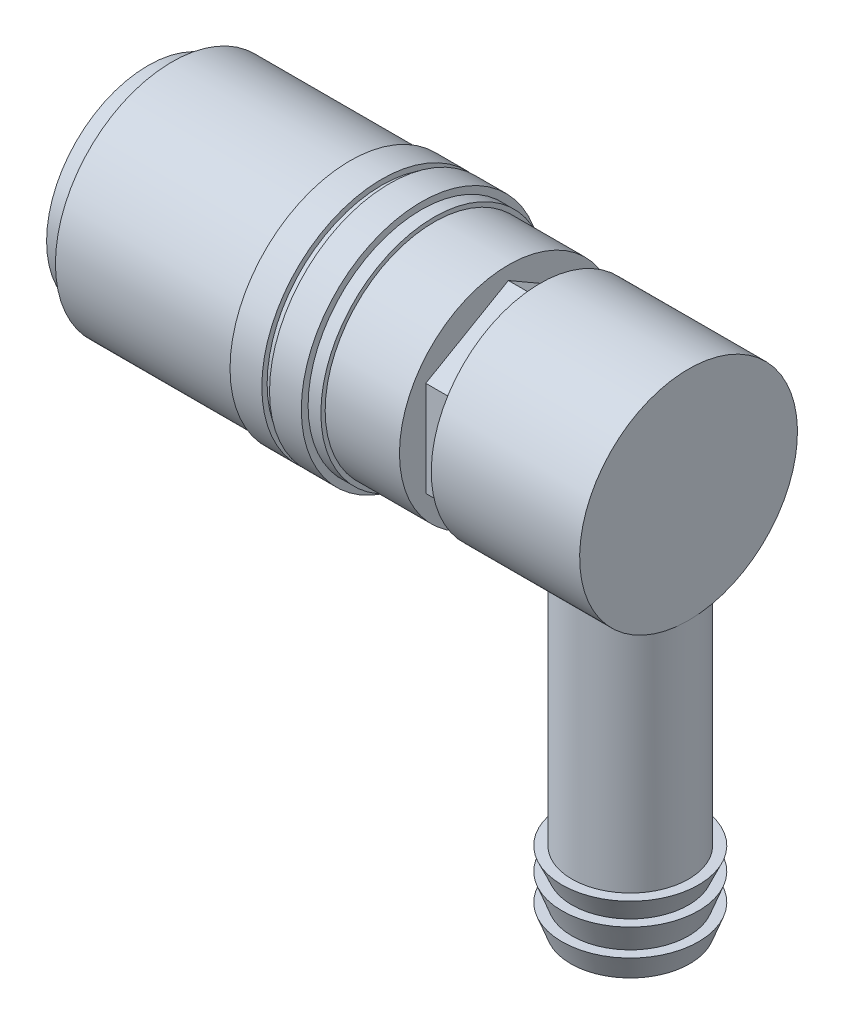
ISO-10303-21;
HEADER;
FILE_DESCRIPTION(('STEP AP214'),'2;1');
FILE_NAME('part.step','',(''),(''),'','','');
FILE_SCHEMA(('AUTOMOTIVE_DESIGN { 1 0 10303 214 1 1 1 1 }'));
ENDSEC;
DATA;
#1=APPLICATION_CONTEXT('core data for automotive mechanical design processes');
#2=APPLICATION_PROTOCOL_DEFINITION('international standard','automotive_design',2000,#1);
#3=PRODUCT_CONTEXT('',#1,'mechanical');
#4=PRODUCT('Part','Part','',(#3));
#5=PRODUCT_RELATED_PRODUCT_CATEGORY('part','',(#4));
#6=PRODUCT_DEFINITION_FORMATION('','',#4);
#7=PRODUCT_DEFINITION_CONTEXT('part definition',#1,'design');
#8=PRODUCT_DEFINITION('design','',#6,#7);
#9=PRODUCT_DEFINITION_SHAPE('','',#8);
#10=(LENGTH_UNIT() NAMED_UNIT(*) SI_UNIT(.MILLI.,.METRE.));
#11=(NAMED_UNIT(*) PLANE_ANGLE_UNIT() SI_UNIT($,.RADIAN.));
#12=(NAMED_UNIT(*) SI_UNIT($,.STERADIAN.) SOLID_ANGLE_UNIT());
#13=UNCERTAINTY_MEASURE_WITH_UNIT(LENGTH_MEASURE(1.E-05),#10,'distance_accuracy_value','');
#14=(GEOMETRIC_REPRESENTATION_CONTEXT(3) GLOBAL_UNCERTAINTY_ASSIGNED_CONTEXT((#13)) GLOBAL_UNIT_ASSIGNED_CONTEXT((#10,
#11,#12)) REPRESENTATION_CONTEXT('',''));
#15=CARTESIAN_POINT('',(0.,0.,0.));
#16=DIRECTION('',(0.,0.,1.));
#17=DIRECTION('',(1.,0.,0.));
#18=AXIS2_PLACEMENT_3D('',#15,#16,#17);
#19=CARTESIAN_POINT('',(51.,0.,0.));
#20=DIRECTION('',(-1.,0.,0.));
#21=DIRECTION('',(0.,0.,1.));
#22=AXIS2_PLACEMENT_3D('',#19,#20,#21);
#23=CYLINDRICAL_SURFACE('',#22,10.2763207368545);
#24=CARTESIAN_POINT('',(37.,0.,0.));
#25=DIRECTION('',(1.,0.,0.));
#26=DIRECTION('',(0.,0.,-1.));
#27=AXIS2_PLACEMENT_3D('',#24,#25,#26);
#28=CIRCLE('',#27,10.2763207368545);
#29=CARTESIAN_POINT('',(37.,0.,-10.2763207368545));
#30=VERTEX_POINT('',#29);
#31=EDGE_CURVE('E79',#30,#30,#28,.T.);
#32=ORIENTED_EDGE('',*,*,#31,.T.);
#33=EDGE_LOOP('',(#32));
#34=FACE_BOUND('',#33,.T.);
#35=CARTESIAN_POINT('',(51.,0.,0.));
#36=DIRECTION('',(1.,0.,0.));
#37=DIRECTION('',(0.,0.,-1.));
#38=AXIS2_PLACEMENT_3D('',#35,#36,#37);
#39=CIRCLE('',#38,10.2763207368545);
#40=CARTESIAN_POINT('',(51.,-10.2763207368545,0.));
#41=VERTEX_POINT('',#40);
#42=EDGE_CURVE('E74',#41,#41,#39,.T.);
#43=ORIENTED_EDGE('',*,*,#42,.F.);
#44=CARTESIAN_POINT('',(51.,-10.2763207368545,0.));
#45=CARTESIAN_POINT('',(51.0000007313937,-10.2763213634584,0.143384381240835));
#46=CARTESIAN_POINT('',(50.9943873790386,-10.273313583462,0.286759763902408));
#47=CARTESIAN_POINT('',(50.9720057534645,-10.2613607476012,0.572438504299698));
#48=CARTESIAN_POINT('',(50.955233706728,-10.252413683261,0.714741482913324));
#49=CARTESIAN_POINT('',(50.910719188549,-10.228797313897,0.997294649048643));
#50=CARTESIAN_POINT('',(50.8829646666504,-10.214121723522,1.1375424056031));
#51=CARTESIAN_POINT('',(50.8168085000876,-10.1794119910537,1.41487883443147));
#52=CARTESIAN_POINT('',(50.7784025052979,-10.1593756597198,1.55196619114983));
#53=CARTESIAN_POINT('',(50.6915661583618,-10.1145315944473,1.82142329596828));
#54=CARTESIAN_POINT('',(50.6431818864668,-10.0897458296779,1.95381156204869));
#55=CARTESIAN_POINT('',(50.5367605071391,-10.0359168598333,2.21377441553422));
#56=CARTESIAN_POINT('',(50.4787197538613,-10.00687204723,2.34134716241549));
#57=CARTESIAN_POINT('',(50.2909113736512,-9.91431573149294,2.71569378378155));
#58=CARTESIAN_POINT('',(50.1473689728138,-9.84533512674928,2.95436795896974));
#59=CARTESIAN_POINT('',(49.8170752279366,-9.693657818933,3.42051176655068));
#60=CARTESIAN_POINT('',(49.6280876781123,-9.61035449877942,3.64618510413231));
#61=CARTESIAN_POINT('',(49.2171598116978,-9.44112784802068,4.06433316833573));
#62=CARTESIAN_POINT('',(48.9951907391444,-9.35520228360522,4.25677860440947));
#63=CARTESIAN_POINT('',(48.4999870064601,-9.18119507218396,4.62091035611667));
#64=CARTESIAN_POINT('',(48.2239144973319,-9.09364255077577,4.78905710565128));
#65=CARTESIAN_POINT('',(47.7881515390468,-8.97601207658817,5.00406630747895));
#66=CARTESIAN_POINT('',(47.6392358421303,-8.93907511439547,5.06954957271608));
#67=CARTESIAN_POINT('',(47.3350241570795,-8.87119759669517,5.1874118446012));
#68=CARTESIAN_POINT('',(47.179732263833,-8.84025326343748,5.23979911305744));
#69=CARTESIAN_POINT('',(46.8736914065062,-8.78740611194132,5.32792091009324));
#70=CARTESIAN_POINT('',(46.723257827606,-8.76506163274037,5.36448660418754));
#71=CARTESIAN_POINT('',(46.4190208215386,-8.72780632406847,5.42488975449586));
#72=CARTESIAN_POINT('',(46.2652193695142,-8.71289125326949,5.44873447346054));
#73=CARTESIAN_POINT('',(45.9557052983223,-8.69118093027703,5.48329841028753));
#74=CARTESIAN_POINT('',(45.7999943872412,-8.68437888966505,5.49402860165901));
#75=CARTESIAN_POINT('',(45.4880924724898,-8.67920557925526,5.50219829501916));
#76=CARTESIAN_POINT('',(45.3319015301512,-8.68083327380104,5.49963942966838));
#77=CARTESIAN_POINT('',(45.0428041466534,-8.69160415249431,5.48259604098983));
#78=CARTESIAN_POINT('',(44.9097485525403,-8.69964436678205,5.46986123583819));
#79=CARTESIAN_POINT('',(44.6453503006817,-8.72157289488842,5.43482861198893));
#80=CARTESIAN_POINT('',(44.5140081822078,-8.73546300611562,5.41252785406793));
#81=CARTESIAN_POINT('',(44.2539460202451,-8.76862508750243,5.3586360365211));
#82=CARTESIAN_POINT('',(44.1252258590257,-8.78789681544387,5.327045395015));
#83=CARTESIAN_POINT('',(43.8711188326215,-8.83121260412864,5.25492298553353));
#84=CARTESIAN_POINT('',(43.7457333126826,-8.85525855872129,5.21438766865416));
#85=CARTESIAN_POINT('',(43.3701504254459,-8.93467483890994,5.07795428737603));
#86=CARTESIAN_POINT('',(43.1261382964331,-8.99656314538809,4.96840138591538));
#87=CARTESIAN_POINT('',(42.6588488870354,-9.13096923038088,4.71682661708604));
#88=CARTESIAN_POINT('',(42.4355808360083,-9.20349170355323,4.57479039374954));
#89=CARTESIAN_POINT('',(41.9811566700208,-9.36394100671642,4.23782400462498));
#90=CARTESIAN_POINT('',(41.7537312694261,-9.45255834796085,4.03817526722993));
#91=CARTESIAN_POINT('',(41.3338285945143,-9.6266916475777,3.60337503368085));
#92=CARTESIAN_POINT('',(41.1413729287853,-9.71220566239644,3.36820174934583));
#93=CARTESIAN_POINT('',(40.877475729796,-9.83432629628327,2.98468842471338));
#94=CARTESIAN_POINT('',(40.7916210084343,-9.87505563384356,2.8473743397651));
#95=CARTESIAN_POINT('',(40.6319279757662,-9.95218536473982,2.56479583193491));
#96=CARTESIAN_POINT('',(40.5580845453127,-9.98858760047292,2.41953483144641));
#97=CARTESIAN_POINT('',(40.4232337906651,-10.0559890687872,2.12205274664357));
#98=CARTESIAN_POINT('',(40.3622203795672,-10.0869908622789,1.96983500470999));
#99=CARTESIAN_POINT('',(40.2537631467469,-10.1426623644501,1.65951781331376));
#100=CARTESIAN_POINT('',(40.2063175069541,-10.1673329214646,1.50141915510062));
#101=CARTESIAN_POINT('',(40.1293222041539,-10.2076429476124,1.19517893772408));
#102=CARTESIAN_POINT('',(40.098543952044,-10.2238964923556,1.04742632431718));
#103=CARTESIAN_POINT('',(40.0491933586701,-10.2500546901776,0.749347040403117));
#104=CARTESIAN_POINT('',(40.030619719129,-10.2599600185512,0.599020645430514));
#105=CARTESIAN_POINT('',(40.0059448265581,-10.2731349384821,0.297128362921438));
#106=CARTESIAN_POINT('',(39.9998377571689,-10.2764076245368,0.145563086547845));
#107=CARTESIAN_POINT('',(40.0001687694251,-10.2762303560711,-0.157545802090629));
#108=CARTESIAN_POINT('',(40.0066061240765,-10.272780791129,-0.309089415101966));
#109=CARTESIAN_POINT('',(40.0307638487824,-10.2598840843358,-0.59696506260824));
#110=CARTESIAN_POINT('',(40.0473941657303,-10.2510166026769,-0.733416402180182));
#111=CARTESIAN_POINT('',(40.090730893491,-10.228031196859,-1.00430416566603));
#112=CARTESIAN_POINT('',(40.1174404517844,-10.2139116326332,-1.1387399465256));
#113=CARTESIAN_POINT('',(40.180629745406,-10.180753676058,-1.40462367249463));
#114=CARTESIAN_POINT('',(40.2171063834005,-10.1617168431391,-1.5360725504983));
#115=CARTESIAN_POINT('',(40.299475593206,-10.1191392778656,-1.79528551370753));
#116=CARTESIAN_POINT('',(40.3453718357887,-10.0955967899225,-1.92304814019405));
#117=CARTESIAN_POINT('',(40.4473760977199,-10.0438933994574,-2.17719769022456));
#118=CARTESIAN_POINT('',(40.5037048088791,-10.0156343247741,-2.30347607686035));
#119=CARTESIAN_POINT('',(40.6253158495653,-9.9555275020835,-2.55077637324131));
#120=CARTESIAN_POINT('',(40.6906012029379,-9.92367854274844,-2.67179648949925));
#121=CARTESIAN_POINT('',(40.8991523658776,-9.82372684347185,-3.02609576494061));
#122=CARTESIAN_POINT('',(41.0551699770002,-9.75118969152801,-3.25075381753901));
#123=CARTESIAN_POINT('',(41.4160266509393,-9.59180082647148,-3.6962157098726));
#124=CARTESIAN_POINT('',(41.6243212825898,-9.50424945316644,-3.91397370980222));
#125=CARTESIAN_POINT('',(41.9612584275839,-9.37362008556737,-4.2130667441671));
#126=CARTESIAN_POINT('',(42.0777588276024,-9.33015793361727,-4.30824039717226));
#127=CARTESIAN_POINT('',(42.3185314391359,-9.2445575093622,-4.48897608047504));
#128=CARTESIAN_POINT('',(42.4428049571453,-9.20241946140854,-4.57453648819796));
#129=CARTESIAN_POINT('',(42.7073735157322,-9.11782656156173,-4.74102559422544));
#130=CARTESIAN_POINT('',(42.8481825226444,-9.07554974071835,-4.82122953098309));
#131=CARTESIAN_POINT('',(43.137258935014,-8.99533482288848,-4.96928642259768));
#132=CARTESIAN_POINT('',(43.285522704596,-8.95739463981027,-5.03714532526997));
#133=CARTESIAN_POINT('',(43.588556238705,-8.88733276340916,-5.15975496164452));
#134=CARTESIAN_POINT('',(43.7433200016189,-8.85520584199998,-5.21451748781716));
#135=CARTESIAN_POINT('',(44.0583440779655,-8.7981344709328,-5.31024604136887));
#136=CARTESIAN_POINT('',(44.2186034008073,-8.77318873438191,-5.35121454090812));
#137=CARTESIAN_POINT('',(44.5273175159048,-8.73371553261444,-5.41537218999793));
#138=CARTESIAN_POINT('',(44.6753928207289,-8.71840744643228,-5.4399088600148));
#139=CARTESIAN_POINT('',(44.9736343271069,-8.69527106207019,-5.47681557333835));
#140=CARTESIAN_POINT('',(45.1238003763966,-8.68744222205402,-5.48918649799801));
#141=CARTESIAN_POINT('',(45.4247562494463,-8.67962064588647,-5.50154591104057));
#142=CARTESIAN_POINT('',(45.5755456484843,-8.67962324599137,-5.50154176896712));
#143=CARTESIAN_POINT('',(45.8764027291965,-8.68745275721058,-5.48916988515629));
#144=CARTESIAN_POINT('',(46.0264704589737,-8.69527913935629,-5.47680297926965));
#145=CARTESIAN_POINT('',(46.3060843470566,-8.71697056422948,-5.44220069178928));
#146=CARTESIAN_POINT('',(46.4358749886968,-8.72996995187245,-5.42137351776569));
#147=CARTESIAN_POINT('',(46.6930374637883,-8.761266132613,-5.37064815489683));
#148=CARTESIAN_POINT('',(46.8204084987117,-8.77956464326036,-5.34074702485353));
#149=CARTESIAN_POINT('',(47.1977255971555,-8.84158779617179,-5.2378981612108));
#150=CARTESIAN_POINT('',(47.4430393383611,-8.89245388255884,-5.15178422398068));
#151=CARTESIAN_POINT('',(47.9314845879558,-9.01138043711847,-4.94097714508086));
#152=CARTESIAN_POINT('',(48.1734672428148,-9.08033439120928,-4.81416406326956));
#153=CARTESIAN_POINT('',(48.6343820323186,-9.22655460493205,-4.52761771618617));
#154=CARTESIAN_POINT('',(48.8533016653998,-9.30382532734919,-4.36786673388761));
#155=CARTESIAN_POINT('',(49.2951580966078,-9.4714445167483,-3.99282049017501));
#156=CARTESIAN_POINT('',(49.5140144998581,-9.56205516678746,-3.77282095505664));
#157=CARTESIAN_POINT('',(49.9130394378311,-9.73629475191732,-3.29716926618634));
#158=CARTESIAN_POINT('',(50.0931826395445,-9.81991909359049,-3.04149394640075));
#159=CARTESIAN_POINT('',(50.332023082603,-9.93459736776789,-2.63200830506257));
#160=CARTESIAN_POINT('',(50.4071587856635,-9.97142996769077,-2.48917711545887));
#161=CARTESIAN_POINT('',(50.5449614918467,-10.0399610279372,-2.19647140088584));
#162=CARTESIAN_POINT('',(50.6076346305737,-10.071662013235,-2.04660038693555));
#163=CARTESIAN_POINT('',(50.7196479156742,-10.1289279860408,-1.7411740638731));
#164=CARTESIAN_POINT('',(50.7690147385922,-10.1545052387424,-1.58563084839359));
#165=CARTESIAN_POINT('',(50.8538752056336,-10.1987957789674,-1.26992675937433));
#166=CARTESIAN_POINT('',(50.8893764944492,-10.2175128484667,-1.10976848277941));
#167=CARTESIAN_POINT('',(50.9449782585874,-10.2469518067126,-0.792017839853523));
#168=CARTESIAN_POINT('',(50.9655833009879,-10.2579352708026,-0.63453799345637));
#169=CARTESIAN_POINT('',(50.9930938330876,-10.2726194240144,-0.318035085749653));
#170=CARTESIAN_POINT('',(50.9999991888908,-10.2763200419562,-0.159012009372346));
#171=CARTESIAN_POINT('',(51.,-10.2763207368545,0.));
#172=B_SPLINE_CURVE_WITH_KNOTS('',3,(#44,#45,#46,#47,#48,#49,#50,#51,#52,#53,#54,#55,#56,#57,
#58,#59,#60,#61,#62,#63,#64,#65,#66,#67,#68,#69,#70,#71,#72,#73,#74,#75,#76,#77,#78,#79,#80,#81,
#82,#83,#84,#85,#86,#87,#88,#89,#90,#91,#92,#93,#94,#95,#96,#97,#98,#99,#100,#101,#102,#103,
#104,#105,#106,#107,#108,#109,#110,#111,#112,#113,#114,#115,#116,#117,#118,#119,#120,#121,#122,
#123,#124,#125,#126,#127,#128,#129,#130,#131,#132,#133,#134,#135,#136,#137,#138,#139,#140,#141,
#142,#143,#144,#145,#146,#147,#148,#149,#150,#151,#152,#153,#154,#155,#156,#157,#158,#159,#160,
#161,#162,#163,#164,#165,#166,#167,#168,#169,#170,#171),.UNSPECIFIED.,.T.,.F.,(4,2,2,2,2,2,2,2,
2,2,2,2,2,2,2,2,2,2,2,2,2,2,2,2,2,2,2,2,2,2,2,2,2,2,2,2,2,2,2,2,2,2,2,2,2,2,2,2,2,2,2,2,2,2,2,2,
2,2,2,2,2,2,2,4),(0.,0.429997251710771,0.86013998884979,1.29075601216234,1.72154816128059,
2.15039373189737,2.57940158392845,3.43655755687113,4.35062885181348,5.2655018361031,
6.26455728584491,6.76441267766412,7.26395192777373,7.73251618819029,8.20081264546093,
8.66871698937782,9.13656384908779,9.53780349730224,9.93916651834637,10.3405114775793,
10.7420159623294,11.5621823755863,12.3827119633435,13.3247882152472,14.2674446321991,
14.7678416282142,15.2680247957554,15.767970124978,16.2678484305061,16.7226167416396,
17.177336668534,17.6318443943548,18.0863257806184,18.4990849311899,18.9119730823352,
19.3247304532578,19.7376489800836,20.1605831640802,20.5836604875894,21.4293583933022,
22.3665396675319,22.8358998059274,23.3053390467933,23.8071073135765,24.3086331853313,
24.8097057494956,25.3106884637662,25.7626464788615,26.2145717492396,26.6662278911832,
27.1178534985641,27.5136744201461,27.909623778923,28.7010315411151,29.5431926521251,
30.3858079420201,31.3514508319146,32.3177237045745,32.8137559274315,33.3095433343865,
33.8043292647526,34.2988420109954,34.7757004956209,35.2525636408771),.UNSPECIFIED.);
#173=EDGE_CURVE('E76',#41,#41,#172,.T.);
#174=ORIENTED_EDGE('',*,*,#173,.F.);
#175=EDGE_LOOP('',(#43,#174));
#176=FACE_BOUND('',#175,.T.);
#177=ADVANCED_FACE('F15',(#34,#176),#23,.T.);
#178=CARTESIAN_POINT('',(34.,6.8,0.));
#179=DIRECTION('',(-1.,0.,0.));
#180=DIRECTION('',(0.,0.,1.));
#181=AXIS2_PLACEMENT_3D('',#178,#179,#180);
#182=PLANE('',#181);
#183=CARTESIAN_POINT('',(34.,0.,0.));
#184=DIRECTION('',(-1.,0.,0.));
#185=DIRECTION('',(0.,0.,1.));
#186=AXIS2_PLACEMENT_3D('',#183,#184,#185);
#187=CIRCLE('',#186,10.2763207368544);
#188=CARTESIAN_POINT('',(34.,0.,10.2763207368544));
#189=VERTEX_POINT('',#188);
#190=EDGE_CURVE('E180',#189,#189,#187,.T.);
#191=ORIENTED_EDGE('',*,*,#190,.F.);
#192=EDGE_LOOP('',(#191));
#193=FACE_BOUND('',#192,.T.);
#194=DIRECTION('',(0.,0.5,0.866025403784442));
#195=VECTOR('',#194,1.);
#196=CARTESIAN_POINT('',(34.,4.50000000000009,-7.7942286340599));
#197=LINE('',#196,#195);
#198=CARTESIAN_POINT('',(34.,4.50000000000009,-7.7942286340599));
#199=VERTEX_POINT('',#198);
#200=CARTESIAN_POINT('',(34.,9.,0.));
#201=VERTEX_POINT('',#200);
#202=EDGE_CURVE('E95',#199,#201,#197,.T.);
#203=ORIENTED_EDGE('',*,*,#202,.F.);
#204=DIRECTION('',(0.,1.,0.));
#205=VECTOR('',#204,1.);
#206=CARTESIAN_POINT('',(34.,-4.49999999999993,-7.79422863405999));
#207=LINE('',#206,#205);
#208=CARTESIAN_POINT('',(34.,-4.49999999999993,-7.79422863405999));
#209=VERTEX_POINT('',#208);
#210=EDGE_CURVE('E100',#209,#199,#207,.T.);
#211=ORIENTED_EDGE('',*,*,#210,.F.);
#212=DIRECTION('',(0.,0.500000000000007,-0.866025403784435));
#213=VECTOR('',#212,1.);
#214=CARTESIAN_POINT('',(34.,-9.,0.));
#215=LINE('',#214,#213);
#216=CARTESIAN_POINT('',(34.,-9.,0.));
#217=VERTEX_POINT('',#216);
#218=EDGE_CURVE('E123',#217,#209,#215,.T.);
#219=ORIENTED_EDGE('',*,*,#218,.F.);
#220=DIRECTION('',(0.,-0.5,-0.866025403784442));
#221=VECTOR('',#220,1.);
#222=CARTESIAN_POINT('',(34.,-4.5,7.79422863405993));
#223=LINE('',#222,#221);
#224=CARTESIAN_POINT('',(34.,-4.5,7.79422863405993));
#225=VERTEX_POINT('',#224);
#226=EDGE_CURVE('E120',#225,#217,#223,.T.);
#227=ORIENTED_EDGE('',*,*,#226,.F.);
#228=DIRECTION('',(0.,-1.,0.));
#229=VECTOR('',#228,1.);
#230=CARTESIAN_POINT('',(34.,4.5,7.79422863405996));
#231=LINE('',#230,#229);
#232=CARTESIAN_POINT('',(34.,4.5,7.79422863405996));
#233=VERTEX_POINT('',#232);
#234=EDGE_CURVE('E40',#233,#225,#231,.T.);
#235=ORIENTED_EDGE('',*,*,#234,.F.);
#236=DIRECTION('',(0.,-0.5,0.866025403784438));
#237=VECTOR('',#236,1.);
#238=CARTESIAN_POINT('',(34.,9.,0.));
#239=LINE('',#238,#237);
#240=EDGE_CURVE('E35',#201,#233,#239,.T.);
#241=ORIENTED_EDGE('',*,*,#240,.F.);
#242=EDGE_LOOP('',(#203,#211,#219,#227,#235,#241));
#243=FACE_BOUND('',#242,.T.);
#244=ADVANCED_FACE('F195',(#193,#243),#182,.F.);
#245=CARTESIAN_POINT('',(0.,0.,0.));
#246=DIRECTION('',(-1.,0.,0.));
#247=DIRECTION('',(0.,0.,1.));
#248=AXIS2_PLACEMENT_3D('',#245,#246,#247);
#249=CYLINDRICAL_SURFACE('',#248,9.57299306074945);
#250=CARTESIAN_POINT('',(0.,0.,0.));
#251=DIRECTION('',(-1.,0.,0.));
#252=DIRECTION('',(0.,0.,1.));
#253=AXIS2_PLACEMENT_3D('',#250,#251,#252);
#254=CIRCLE('',#253,9.57299306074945);
#255=CARTESIAN_POINT('',(0.,0.,9.57299306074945));
#256=VERTEX_POINT('',#255);
#257=EDGE_CURVE('E28',#256,#256,#254,.T.);
#258=ORIENTED_EDGE('',*,*,#257,.F.);
#259=EDGE_LOOP('',(#258));
#260=FACE_BOUND('',#259,.T.);
#261=CARTESIAN_POINT('',(2.26082941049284,0.,0.));
#262=DIRECTION('',(-1.,0.,0.));
#263=DIRECTION('',(0.,0.,1.));
#264=AXIS2_PLACEMENT_3D('',#261,#262,#263);
#265=CIRCLE('',#264,9.57299306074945);
#266=CARTESIAN_POINT('',(2.26082941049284,0.,9.57299306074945));
#267=VERTEX_POINT('',#266);
#268=EDGE_CURVE('E144',#267,#267,#265,.T.);
#269=ORIENTED_EDGE('',*,*,#268,.T.);
#270=EDGE_LOOP('',(#269));
#271=FACE_BOUND('',#270,.T.);
#272=ADVANCED_FACE('F17',(#260,#271),#249,.T.);
#273=CARTESIAN_POINT('',(0.,6.8,0.));
#274=DIRECTION('',(1.,0.,0.));
#275=DIRECTION('',(0.,0.,-1.));
#276=AXIS2_PLACEMENT_3D('',#273,#274,#275);
#277=PLANE('',#276);
#278=CARTESIAN_POINT('',(0.,0.,0.));
#279=DIRECTION('',(-1.,0.,0.));
#280=DIRECTION('',(0.,0.,1.));
#281=AXIS2_PLACEMENT_3D('',#278,#279,#280);
#282=CIRCLE('',#281,6.8);
#283=CARTESIAN_POINT('',(0.,0.,6.8));
#284=VERTEX_POINT('',#283);
#285=EDGE_CURVE('E186',#284,#284,#282,.T.);
#286=ORIENTED_EDGE('',*,*,#285,.F.);
#287=EDGE_LOOP('',(#286));
#288=FACE_BOUND('',#287,.T.);
#289=ORIENTED_EDGE('',*,*,#257,.T.);
#290=EDGE_LOOP('',(#289));
#291=FACE_BOUND('',#290,.T.);
#292=ADVANCED_FACE('F191',(#288,#291),#277,.F.);
#293=CARTESIAN_POINT('',(0.,0.,0.));
#294=DIRECTION('',(-1.,0.,0.));
#295=DIRECTION('',(0.,0.,1.));
#296=AXIS2_PLACEMENT_3D('',#293,#294,#295);
#297=CYLINDRICAL_SURFACE('',#296,6.8);
#298=CARTESIAN_POINT('',(34.,0.,0.));
#299=DIRECTION('',(-1.,0.,0.));
#300=DIRECTION('',(0.,0.,1.));
#301=AXIS2_PLACEMENT_3D('',#298,#299,#300);
#302=CIRCLE('',#301,6.8);
#303=CARTESIAN_POINT('',(34.,0.,6.8));
#304=VERTEX_POINT('',#303);
#305=EDGE_CURVE('E183',#304,#304,#302,.T.);
#306=ORIENTED_EDGE('',*,*,#305,.F.);
#307=EDGE_LOOP('',(#306));
#308=FACE_BOUND('',#307,.T.);
#309=ORIENTED_EDGE('',*,*,#285,.T.);
#310=EDGE_LOOP('',(#309));
#311=FACE_BOUND('',#310,.T.);
#312=ADVANCED_FACE('F268',(#308,#311),#297,.F.);
#313=CARTESIAN_POINT('',(0.,0.,0.));
#314=DIRECTION('',(-1.,0.,0.));
#315=DIRECTION('',(0.,0.,1.));
#316=AXIS2_PLACEMENT_3D('',#313,#314,#315);
#317=CYLINDRICAL_SURFACE('',#316,10.2763207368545);
#318=CARTESIAN_POINT('',(26.9893792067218,0.,0.));
#319=DIRECTION('',(-1.,0.,0.));
#320=DIRECTION('',(0.,0.,1.));
#321=AXIS2_PLACEMENT_3D('',#318,#319,#320);
#322=CIRCLE('',#321,10.2763207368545);
#323=CARTESIAN_POINT('',(26.9893792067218,0.,10.2763207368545));
#324=VERTEX_POINT('',#323);
#325=EDGE_CURVE('E177',#324,#324,#322,.T.);
#326=ORIENTED_EDGE('',*,*,#325,.F.);
#327=EDGE_LOOP('',(#326));
#328=FACE_BOUND('',#327,.T.);
#329=ORIENTED_EDGE('',*,*,#190,.T.);
#330=EDGE_LOOP('',(#329));
#331=FACE_BOUND('',#330,.T.);
#332=ADVANCED_FACE('F262',(#328,#331),#317,.T.);
#333=CARTESIAN_POINT('',(26.9893792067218,10.6817722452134,0.));
#334=DIRECTION('',(-1.,0.,0.));
#335=DIRECTION('',(0.,0.,1.));
#336=AXIS2_PLACEMENT_3D('',#333,#334,#335);
#337=PLANE('',#336);
#338=CARTESIAN_POINT('',(26.9893792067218,0.,0.));
#339=DIRECTION('',(-1.,0.,0.));
#340=DIRECTION('',(0.,0.,1.));
#341=AXIS2_PLACEMENT_3D('',#338,#339,#340);
#342=CIRCLE('',#341,10.6817722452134);
#343=CARTESIAN_POINT('',(26.9893792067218,0.,10.6817722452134));
#344=VERTEX_POINT('',#343);
#345=EDGE_CURVE('E174',#344,#344,#342,.T.);
#346=ORIENTED_EDGE('',*,*,#345,.F.);
#347=EDGE_LOOP('',(#346));
#348=FACE_BOUND('',#347,.T.);
#349=ORIENTED_EDGE('',*,*,#325,.T.);
#350=EDGE_LOOP('',(#349));
#351=FACE_BOUND('',#350,.T.);
#352=ADVANCED_FACE('F256',(#348,#351),#337,.F.);
#353=CARTESIAN_POINT('',(0.,0.,0.));
#354=DIRECTION('',(-1.,0.,0.));
#355=DIRECTION('',(0.,0.,1.));
#356=AXIS2_PLACEMENT_3D('',#353,#354,#355);
#357=CYLINDRICAL_SURFACE('',#356,10.6817722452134);
#358=CARTESIAN_POINT('',(25.7841800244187,0.,0.));
#359=DIRECTION('',(-1.,0.,0.));
#360=DIRECTION('',(0.,0.,1.));
#361=AXIS2_PLACEMENT_3D('',#358,#359,#360);
#362=CIRCLE('',#361,10.6817722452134);
#363=CARTESIAN_POINT('',(25.7841800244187,0.,10.6817722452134));
#364=VERTEX_POINT('',#363);
#365=EDGE_CURVE('E171',#364,#364,#362,.T.);
#366=ORIENTED_EDGE('',*,*,#365,.F.);
#367=EDGE_LOOP('',(#366));
#368=FACE_BOUND('',#367,.T.);
#369=ORIENTED_EDGE('',*,*,#345,.T.);
#370=EDGE_LOOP('',(#369));
#371=FACE_BOUND('',#370,.T.);
#372=ADVANCED_FACE('F250',(#368,#371),#357,.T.);
#373=CARTESIAN_POINT('',(25.7841800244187,11.3216876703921,0.));
#374=DIRECTION('',(-1.,0.,0.));
#375=DIRECTION('',(0.,0.,1.));
#376=AXIS2_PLACEMENT_3D('',#373,#374,#375);
#377=PLANE('',#376);
#378=CARTESIAN_POINT('',(25.7841800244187,0.,0.));
#379=DIRECTION('',(-1.,0.,0.));
#380=DIRECTION('',(0.,0.,1.));
#381=AXIS2_PLACEMENT_3D('',#378,#379,#380);
#382=CIRCLE('',#381,11.3216876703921);
#383=CARTESIAN_POINT('',(25.7841800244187,0.,11.3216876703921));
#384=VERTEX_POINT('',#383);
#385=EDGE_CURVE('E168',#384,#384,#382,.T.);
#386=ORIENTED_EDGE('',*,*,#385,.F.);
#387=EDGE_LOOP('',(#386));
#388=FACE_BOUND('',#387,.T.);
#389=ORIENTED_EDGE('',*,*,#365,.T.);
#390=EDGE_LOOP('',(#389));
#391=FACE_BOUND('',#390,.T.);
#392=ADVANCED_FACE('F244',(#388,#391),#377,.F.);
#393=CARTESIAN_POINT('',(0.,0.,0.));
#394=DIRECTION('',(-1.,0.,0.));
#395=DIRECTION('',(0.,0.,1.));
#396=AXIS2_PLACEMENT_3D('',#393,#394,#395);
#397=CYLINDRICAL_SURFACE('',#396,11.3216876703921);
#398=CARTESIAN_POINT('',(22.7841800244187,0.,0.));
#399=DIRECTION('',(-1.,0.,0.));
#400=DIRECTION('',(0.,0.,1.));
#401=AXIS2_PLACEMENT_3D('',#398,#399,#400);
#402=CIRCLE('',#401,11.3216876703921);
#403=CARTESIAN_POINT('',(22.7841800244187,0.,11.3216876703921));
#404=VERTEX_POINT('',#403);
#405=EDGE_CURVE('E165',#404,#404,#402,.T.);
#406=ORIENTED_EDGE('',*,*,#405,.F.);
#407=EDGE_LOOP('',(#406));
#408=FACE_BOUND('',#407,.T.);
#409=ORIENTED_EDGE('',*,*,#385,.T.);
#410=EDGE_LOOP('',(#409));
#411=FACE_BOUND('',#410,.T.);
#412=ADVANCED_FACE('F238',(#408,#411),#397,.T.);
#413=CARTESIAN_POINT('',(22.7841800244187,10.8216876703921,0.));
#414=DIRECTION('',(1.,0.,0.));
#415=DIRECTION('',(0.,0.,-1.));
#416=AXIS2_PLACEMENT_3D('',#413,#414,#415);
#417=PLANE('',#416);
#418=CARTESIAN_POINT('',(22.7841800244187,0.,0.));
#419=DIRECTION('',(-1.,0.,0.));
#420=DIRECTION('',(0.,0.,1.));
#421=AXIS2_PLACEMENT_3D('',#418,#419,#420);
#422=CIRCLE('',#421,10.8216876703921);
#423=CARTESIAN_POINT('',(22.7841800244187,0.,10.8216876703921));
#424=VERTEX_POINT('',#423);
#425=EDGE_CURVE('E162',#424,#424,#422,.T.);
#426=ORIENTED_EDGE('',*,*,#425,.F.);
#427=EDGE_LOOP('',(#426));
#428=FACE_BOUND('',#427,.T.);
#429=ORIENTED_EDGE('',*,*,#405,.T.);
#430=EDGE_LOOP('',(#429));
#431=FACE_BOUND('',#430,.T.);
#432=ADVANCED_FACE('F232',(#428,#431),#417,.F.);
#433=CARTESIAN_POINT('',(0.,0.,0.));
#434=DIRECTION('',(-1.,0.,0.));
#435=DIRECTION('',(0.,0.,1.));
#436=AXIS2_PLACEMENT_3D('',#433,#434,#435);
#437=CYLINDRICAL_SURFACE('',#436,10.8216876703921);
#438=CARTESIAN_POINT('',(22.0582244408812,0.,0.));
#439=DIRECTION('',(-1.,0.,0.));
#440=DIRECTION('',(0.,0.,1.));
#441=AXIS2_PLACEMENT_3D('',#438,#439,#440);
#442=CIRCLE('',#441,10.8216876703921);
#443=CARTESIAN_POINT('',(22.0582244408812,0.,10.8216876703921));
#444=VERTEX_POINT('',#443);
#445=EDGE_CURVE('E159',#444,#444,#442,.T.);
#446=ORIENTED_EDGE('',*,*,#445,.F.);
#447=EDGE_LOOP('',(#446));
#448=FACE_BOUND('',#447,.T.);
#449=ORIENTED_EDGE('',*,*,#425,.T.);
#450=EDGE_LOOP('',(#449));
#451=FACE_BOUND('',#450,.T.);
#452=ADVANCED_FACE('F226',(#448,#451),#437,.T.);
#453=CARTESIAN_POINT('',(22.0582244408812,11.3216876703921,0.));
#454=DIRECTION('',(-1.,0.,0.));
#455=DIRECTION('',(0.,0.,1.));
#456=AXIS2_PLACEMENT_3D('',#453,#454,#455);
#457=PLANE('',#456);
#458=CARTESIAN_POINT('',(22.0582244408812,0.,0.));
#459=DIRECTION('',(-1.,0.,0.));
#460=DIRECTION('',(0.,0.,1.));
#461=AXIS2_PLACEMENT_3D('',#458,#459,#460);
#462=CIRCLE('',#461,11.3216876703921);
#463=CARTESIAN_POINT('',(22.0582244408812,0.,11.3216876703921));
#464=VERTEX_POINT('',#463);
#465=EDGE_CURVE('E156',#464,#464,#462,.T.);
#466=ORIENTED_EDGE('',*,*,#465,.F.);
#467=EDGE_LOOP('',(#466));
#468=FACE_BOUND('',#467,.T.);
#469=ORIENTED_EDGE('',*,*,#445,.T.);
#470=EDGE_LOOP('',(#469));
#471=FACE_BOUND('',#470,.T.);
#472=ADVANCED_FACE('F220',(#468,#471),#457,.F.);
#473=CARTESIAN_POINT('',(0.,0.,0.));
#474=DIRECTION('',(-1.,0.,0.));
#475=DIRECTION('',(0.,0.,1.));
#476=AXIS2_PLACEMENT_3D('',#473,#474,#475);
#477=CYLINDRICAL_SURFACE('',#476,11.3216876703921);
#478=CARTESIAN_POINT('',(19.0582244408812,0.,0.));
#479=DIRECTION('',(-1.,0.,0.));
#480=DIRECTION('',(0.,0.,1.));
#481=AXIS2_PLACEMENT_3D('',#478,#479,#480);
#482=CIRCLE('',#481,11.3216876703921);
#483=CARTESIAN_POINT('',(19.0582244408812,0.,11.3216876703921));
#484=VERTEX_POINT('',#483);
#485=EDGE_CURVE('E153',#484,#484,#482,.T.);
#486=ORIENTED_EDGE('',*,*,#485,.F.);
#487=EDGE_LOOP('',(#486));
#488=FACE_BOUND('',#487,.T.);
#489=ORIENTED_EDGE('',*,*,#465,.T.);
#490=EDGE_LOOP('',(#489));
#491=FACE_BOUND('',#490,.T.);
#492=ADVANCED_FACE('F214',(#488,#491),#477,.T.);
#493=CARTESIAN_POINT('',(19.0582244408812,11.,0.));
#494=DIRECTION('',(1.,0.,0.));
#495=DIRECTION('',(0.,0.,-1.));
#496=AXIS2_PLACEMENT_3D('',#493,#494,#495);
#497=PLANE('',#496);
#498=CARTESIAN_POINT('',(19.0582244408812,0.,0.));
#499=DIRECTION('',(-1.,0.,0.));
#500=DIRECTION('',(0.,0.,1.));
#501=AXIS2_PLACEMENT_3D('',#498,#499,#500);
#502=CIRCLE('',#501,11.);
#503=CARTESIAN_POINT('',(19.0582244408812,0.,11.));
#504=VERTEX_POINT('',#503);
#505=EDGE_CURVE('E150',#504,#504,#502,.T.);
#506=ORIENTED_EDGE('',*,*,#505,.F.);
#507=EDGE_LOOP('',(#506));
#508=FACE_BOUND('',#507,.T.);
#509=ORIENTED_EDGE('',*,*,#485,.T.);
#510=EDGE_LOOP('',(#509));
#511=FACE_BOUND('',#510,.T.);
#512=ADVANCED_FACE('F208',(#508,#511),#497,.F.);
#513=CARTESIAN_POINT('',(0.,0.,0.));
#514=DIRECTION('',(-1.,0.,0.));
#515=DIRECTION('',(0.,0.,1.));
#516=AXIS2_PLACEMENT_3D('',#513,#514,#515);
#517=CYLINDRICAL_SURFACE('',#516,11.);
#518=CARTESIAN_POINT('',(2.26082941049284,0.,0.));
#519=DIRECTION('',(-1.,0.,0.));
#520=DIRECTION('',(0.,0.,1.));
#521=AXIS2_PLACEMENT_3D('',#518,#519,#520);
#522=CIRCLE('',#521,11.);
#523=CARTESIAN_POINT('',(2.26082941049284,0.,11.));
#524=VERTEX_POINT('',#523);
#525=EDGE_CURVE('E147',#524,#524,#522,.T.);
#526=ORIENTED_EDGE('',*,*,#525,.F.);
#527=EDGE_LOOP('',(#526));
#528=FACE_BOUND('',#527,.T.);
#529=ORIENTED_EDGE('',*,*,#505,.T.);
#530=EDGE_LOOP('',(#529));
#531=FACE_BOUND('',#530,.T.);
#532=ADVANCED_FACE('F202',(#528,#531),#517,.T.);
#533=CARTESIAN_POINT('',(2.26082941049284,9.57299306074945,0.));
#534=DIRECTION('',(1.,0.,0.));
#535=DIRECTION('',(0.,0.,-1.));
#536=AXIS2_PLACEMENT_3D('',#533,#534,#535);
#537=PLANE('',#536);
#538=ORIENTED_EDGE('',*,*,#268,.F.);
#539=EDGE_LOOP('',(#538));
#540=FACE_BOUND('',#539,.T.);
#541=ORIENTED_EDGE('',*,*,#525,.T.);
#542=EDGE_LOOP('',(#541));
#543=FACE_BOUND('',#542,.T.);
#544=ADVANCED_FACE('F198',(#540,#543),#537,.F.);
#545=CARTESIAN_POINT('',(34.,0.,0.));
#546=DIRECTION('',(1.,0.,0.));
#547=DIRECTION('',(0.,0.,-1.));
#548=AXIS2_PLACEMENT_3D('',#545,#546,#547);
#549=PLANE('',#548);
#550=CARTESIAN_POINT('',(34.,0.,0.));
#551=DIRECTION('',(1.,0.,0.));
#552=DIRECTION('',(0.,0.,-1.));
#553=AXIS2_PLACEMENT_3D('',#550,#551,#552);
#554=CIRCLE('',#553,4.75);
#555=CARTESIAN_POINT('',(34.,0.,-4.75));
#556=VERTEX_POINT('',#555);
#557=EDGE_CURVE('E82',#556,#556,#554,.T.);
#558=ORIENTED_EDGE('',*,*,#557,.T.);
#559=EDGE_LOOP('',(#558));
#560=FACE_BOUND('',#559,.T.);
#561=ORIENTED_EDGE('',*,*,#305,.T.);
#562=EDGE_LOOP('',(#561));
#563=FACE_BOUND('',#562,.T.);
#564=ADVANCED_FACE('F201',(#560,#563),#549,.F.);
#565=CARTESIAN_POINT('',(37.,4.50000000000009,-7.7942286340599));
#566=DIRECTION('',(0.,-0.866025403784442,0.5));
#567=DIRECTION('',(0.,-0.5,-0.866025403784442));
#568=AXIS2_PLACEMENT_3D('',#565,#566,#567);
#569=PLANE('',#568);
#570=ORIENTED_EDGE('',*,*,#202,.T.);
#571=DIRECTION('',(-1.,0.,0.));
#572=VECTOR('',#571,1.);
#573=CARTESIAN_POINT('',(37.,9.,0.));
#574=LINE('',#573,#572);
#575=CARTESIAN_POINT('',(37.,9.,0.));
#576=VERTEX_POINT('',#575);
#577=EDGE_CURVE('E142',#576,#201,#574,.T.);
#578=ORIENTED_EDGE('',*,*,#577,.F.);
#579=DIRECTION('',(0.,0.5,0.866025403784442));
#580=VECTOR('',#579,1.);
#581=CARTESIAN_POINT('',(37.,4.50000000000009,-7.7942286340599));
#582=LINE('',#581,#580);
#583=CARTESIAN_POINT('',(37.,4.50000000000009,-7.7942286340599));
#584=VERTEX_POINT('',#583);
#585=EDGE_CURVE('E96',#584,#576,#582,.T.);
#586=ORIENTED_EDGE('',*,*,#585,.F.);
#587=DIRECTION('',(-1.,0.,0.));
#588=VECTOR('',#587,1.);
#589=CARTESIAN_POINT('',(37.,4.50000000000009,-7.7942286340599));
#590=LINE('',#589,#588);
#591=EDGE_CURVE('E115',#584,#199,#590,.T.);
#592=ORIENTED_EDGE('',*,*,#591,.T.);
#593=EDGE_LOOP('',(#570,#578,#586,#592));
#594=FACE_BOUND('',#593,.T.);
#595=ADVANCED_FACE('F280',(#594),#569,.F.);
#596=CARTESIAN_POINT('',(37.,9.,0.));
#597=DIRECTION('',(0.,-0.866025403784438,-0.5));
#598=DIRECTION('',(0.,0.5,-0.866025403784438));
#599=AXIS2_PLACEMENT_3D('',#596,#597,#598);
#600=PLANE('',#599);
#601=ORIENTED_EDGE('',*,*,#240,.T.);
#602=DIRECTION('',(-1.,0.,0.));
#603=VECTOR('',#602,1.);
#604=CARTESIAN_POINT('',(37.,4.5,7.79422863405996));
#605=LINE('',#604,#603);
#606=CARTESIAN_POINT('',(37.,4.5,7.79422863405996));
#607=VERTEX_POINT('',#606);
#608=EDGE_CURVE('E139',#607,#233,#605,.T.);
#609=ORIENTED_EDGE('',*,*,#608,.F.);
#610=DIRECTION('',(0.,-0.5,0.866025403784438));
#611=VECTOR('',#610,1.);
#612=CARTESIAN_POINT('',(37.,9.,0.));
#613=LINE('',#612,#611);
#614=EDGE_CURVE('E99',#576,#607,#613,.T.);
#615=ORIENTED_EDGE('',*,*,#614,.F.);
#616=ORIENTED_EDGE('',*,*,#577,.T.);
#617=EDGE_LOOP('',(#601,#609,#615,#616));
#618=FACE_BOUND('',#617,.T.);
#619=ADVANCED_FACE('F294',(#618),#600,.F.);
#620=CARTESIAN_POINT('',(37.,4.5,7.79422863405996));
#621=DIRECTION('',(0.,0.,-1.));
#622=DIRECTION('',(0.,1.,0.));
#623=AXIS2_PLACEMENT_3D('',#620,#621,#622);
#624=PLANE('',#623);
#625=ORIENTED_EDGE('',*,*,#234,.T.);
#626=DIRECTION('',(-1.,0.,0.));
#627=VECTOR('',#626,1.);
#628=CARTESIAN_POINT('',(37.,-4.5,7.79422863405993));
#629=LINE('',#628,#627);
#630=CARTESIAN_POINT('',(37.,-4.5,7.79422863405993));
#631=VERTEX_POINT('',#630);
#632=EDGE_CURVE('E136',#631,#225,#629,.T.);
#633=ORIENTED_EDGE('',*,*,#632,.F.);
#634=DIRECTION('',(0.,-1.,0.));
#635=VECTOR('',#634,1.);
#636=CARTESIAN_POINT('',(37.,4.5,7.79422863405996));
#637=LINE('',#636,#635);
#638=EDGE_CURVE('E103',#607,#631,#637,.T.);
#639=ORIENTED_EDGE('',*,*,#638,.F.);
#640=ORIENTED_EDGE('',*,*,#608,.T.);
#641=EDGE_LOOP('',(#625,#633,#639,#640));
#642=FACE_BOUND('',#641,.T.);
#643=ADVANCED_FACE('F292',(#642),#624,.F.);
#644=CARTESIAN_POINT('',(37.,-4.5,7.79422863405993));
#645=DIRECTION('',(0.,0.866025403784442,-0.5));
#646=DIRECTION('',(0.,0.5,0.866025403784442));
#647=AXIS2_PLACEMENT_3D('',#644,#645,#646);
#648=PLANE('',#647);
#649=ORIENTED_EDGE('',*,*,#226,.T.);
#650=DIRECTION('',(-1.,0.,0.));
#651=VECTOR('',#650,1.);
#652=CARTESIAN_POINT('',(37.,-9.,0.));
#653=LINE('',#652,#651);
#654=CARTESIAN_POINT('',(37.,-9.,0.));
#655=VERTEX_POINT('',#654);
#656=EDGE_CURVE('E133',#655,#217,#653,.T.);
#657=ORIENTED_EDGE('',*,*,#656,.F.);
#658=DIRECTION('',(0.,-0.5,-0.866025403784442));
#659=VECTOR('',#658,1.);
#660=CARTESIAN_POINT('',(37.,-4.5,7.79422863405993));
#661=LINE('',#660,#659);
#662=EDGE_CURVE('E106',#631,#655,#661,.T.);
#663=ORIENTED_EDGE('',*,*,#662,.F.);
#664=ORIENTED_EDGE('',*,*,#632,.T.);
#665=EDGE_LOOP('',(#649,#657,#663,#664));
#666=FACE_BOUND('',#665,.T.);
#667=ADVANCED_FACE('F289',(#666),#648,.F.);
#668=CARTESIAN_POINT('',(37.,-9.,0.));
#669=DIRECTION('',(0.,0.866025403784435,0.500000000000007));
#670=DIRECTION('',(0.,-0.500000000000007,0.866025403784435));
#671=AXIS2_PLACEMENT_3D('',#668,#669,#670);
#672=PLANE('',#671);
#673=ORIENTED_EDGE('',*,*,#218,.T.);
#674=DIRECTION('',(-1.,0.,0.));
#675=VECTOR('',#674,1.);
#676=CARTESIAN_POINT('',(37.,-4.49999999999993,-7.79422863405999));
#677=LINE('',#676,#675);
#678=CARTESIAN_POINT('',(37.,-4.49999999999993,-7.79422863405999));
#679=VERTEX_POINT('',#678);
#680=EDGE_CURVE('E130',#679,#209,#677,.T.);
#681=ORIENTED_EDGE('',*,*,#680,.F.);
#682=DIRECTION('',(0.,0.500000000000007,-0.866025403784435));
#683=VECTOR('',#682,1.);
#684=CARTESIAN_POINT('',(37.,-9.,0.));
#685=LINE('',#684,#683);
#686=EDGE_CURVE('E109',#655,#679,#685,.T.);
#687=ORIENTED_EDGE('',*,*,#686,.F.);
#688=ORIENTED_EDGE('',*,*,#656,.T.);
#689=EDGE_LOOP('',(#673,#681,#687,#688));
#690=FACE_BOUND('',#689,.T.);
#691=ADVANCED_FACE('F287',(#690),#672,.F.);
#692=CARTESIAN_POINT('',(37.,-4.49999999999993,-7.79422863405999));
#693=DIRECTION('',(0.,0.,1.));
#694=DIRECTION('',(0.,-1.,0.));
#695=AXIS2_PLACEMENT_3D('',#692,#693,#694);
#696=PLANE('',#695);
#697=ORIENTED_EDGE('',*,*,#210,.T.);
#698=ORIENTED_EDGE('',*,*,#591,.F.);
#699=DIRECTION('',(0.,1.,0.));
#700=VECTOR('',#699,1.);
#701=CARTESIAN_POINT('',(37.,-4.49999999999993,-7.79422863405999));
#702=LINE('',#701,#700);
#703=EDGE_CURVE('E112',#679,#584,#702,.T.);
#704=ORIENTED_EDGE('',*,*,#703,.F.);
#705=ORIENTED_EDGE('',*,*,#680,.T.);
#706=EDGE_LOOP('',(#697,#698,#704,#705));
#707=FACE_BOUND('',#706,.T.);
#708=ADVANCED_FACE('F278',(#707),#696,.F.);
#709=CARTESIAN_POINT('',(37.,0.,0.));
#710=DIRECTION('',(-1.,0.,0.));
#711=DIRECTION('',(0.,0.,1.));
#712=AXIS2_PLACEMENT_3D('',#709,#710,#711);
#713=CYLINDRICAL_SURFACE('',#712,4.75);
#714=CARTESIAN_POINT('',(37.,0.,0.));
#715=DIRECTION('',(1.,0.,0.));
#716=DIRECTION('',(0.,0.,-1.));
#717=AXIS2_PLACEMENT_3D('',#714,#715,#716);
#718=CIRCLE('',#717,4.75);
#719=CARTESIAN_POINT('',(37.,0.,-4.75));
#720=VERTEX_POINT('',#719);
#721=EDGE_CURVE('E78',#720,#720,#718,.T.);
#722=ORIENTED_EDGE('',*,*,#721,.T.);
#723=EDGE_LOOP('',(#722));
#724=FACE_BOUND('',#723,.T.);
#725=ORIENTED_EDGE('',*,*,#557,.F.);
#726=EDGE_LOOP('',(#725));
#727=FACE_BOUND('',#726,.T.);
#728=ADVANCED_FACE('F349',(#724,#727),#713,.F.);
#729=CARTESIAN_POINT('',(37.,0.,0.));
#730=DIRECTION('',(1.,0.,0.));
#731=DIRECTION('',(0.,0.,-1.));
#732=AXIS2_PLACEMENT_3D('',#729,#730,#731);
#733=PLANE('',#732);
#734=ORIENTED_EDGE('',*,*,#721,.F.);
#735=EDGE_LOOP('',(#734));
#736=FACE_BOUND('',#735,.T.);
#737=ADVANCED_FACE('F338',(#736),#733,.F.);
#738=CARTESIAN_POINT('',(51.,0.,0.));
#739=DIRECTION('',(1.,0.,0.));
#740=DIRECTION('',(0.,0.,-1.));
#741=AXIS2_PLACEMENT_3D('',#738,#739,#740);
#742=PLANE('',#741);
#743=ORIENTED_EDGE('',*,*,#42,.T.);
#744=EDGE_LOOP('',(#743));
#745=FACE_BOUND('',#744,.T.);
#746=ADVANCED_FACE('F337',(#745),#742,.T.);
#747=ORIENTED_EDGE('',*,*,#703,.T.);
#748=ORIENTED_EDGE('',*,*,#585,.T.);
#749=ORIENTED_EDGE('',*,*,#614,.T.);
#750=ORIENTED_EDGE('',*,*,#638,.T.);
#751=ORIENTED_EDGE('',*,*,#662,.T.);
#752=ORIENTED_EDGE('',*,*,#686,.T.);
#753=EDGE_LOOP('',(#747,#748,#749,#750,#751,#752));
#754=FACE_BOUND('',#753,.T.);
#755=ORIENTED_EDGE('',*,*,#31,.F.);
#756=EDGE_LOOP('',(#755));
#757=FACE_BOUND('',#756,.T.);
#758=ADVANCED_FACE('F282',(#754,#757),#733,.F.);
#759=CARTESIAN_POINT('',(45.5,-10.2763207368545,0.));
#760=DIRECTION('',(0.,1.,0.));
#761=DIRECTION('',(0.,0.,1.));
#762=AXIS2_PLACEMENT_3D('',#759,#760,#761);
#763=CYLINDRICAL_SURFACE('',#762,4.5);
#764=CARTESIAN_POINT('',(45.5,-38.2763207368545,0.));
#765=DIRECTION('',(0.,1.,0.));
#766=DIRECTION('',(0.,0.,1.));
#767=AXIS2_PLACEMENT_3D('',#764,#765,#766);
#768=CIRCLE('',#767,4.5);
#769=CARTESIAN_POINT('',(45.5,-38.2763207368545,4.5));
#770=VERTEX_POINT('',#769);
#771=EDGE_CURVE('E638',#770,#770,#768,.T.);
#772=ORIENTED_EDGE('',*,*,#771,.F.);
#773=EDGE_LOOP('',(#772));
#774=FACE_BOUND('',#773,.T.);
#775=CARTESIAN_POINT('',(45.5,-9.23865617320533,4.5));
#776=CARTESIAN_POINT('',(45.6194099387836,-9.2386572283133,4.49999902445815));
#777=CARTESIAN_POINT('',(45.7388552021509,-9.24097941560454,4.49524002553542));
#778=CARTESIAN_POINT('',(45.9768637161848,-9.25018942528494,4.47625630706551));
#779=CARTESIAN_POINT('',(46.0954263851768,-9.25708002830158,4.46202582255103));
#780=CARTESIAN_POINT('',(46.3309689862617,-9.27520734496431,4.42422176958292));
#781=CARTESIAN_POINT('',(46.4479452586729,-9.28645276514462,4.4006294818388));
#782=CARTESIAN_POINT('',(46.6792536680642,-9.31290332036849,4.34437050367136));
#783=CARTESIAN_POINT('',(46.7935846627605,-9.32811013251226,4.31169996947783));
#784=CARTESIAN_POINT('',(47.1303687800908,-9.3788030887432,4.20088856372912));
#785=CARTESIAN_POINT('',(47.3479150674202,-9.41947055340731,4.10973489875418));
#786=CARTESIAN_POINT('',(47.7644606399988,-9.5099432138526,3.89578607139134));
#787=CARTESIAN_POINT('',(47.963462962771,-9.55974690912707,3.77299610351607));
#788=CARTESIAN_POINT('',(48.3512208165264,-9.66671422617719,3.49022267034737));
#789=CARTESIAN_POINT('',(48.5385577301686,-9.72414332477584,3.32839373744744));
#790=CARTESIAN_POINT('',(48.8845537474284,-9.83774391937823,2.97586188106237));
#791=CARTESIAN_POINT('',(49.0432010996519,-9.89391489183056,2.78514718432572));
#792=CARTESIAN_POINT('',(49.2600262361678,-9.97425609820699,2.47571362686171));
#793=CARTESIAN_POINT('',(49.3301327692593,-10.0009533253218,2.36582563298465));
#794=CARTESIAN_POINT('',(49.4607667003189,-10.0517069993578,2.13993573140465));
#795=CARTESIAN_POINT('',(49.5212980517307,-10.0757645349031,2.02393637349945));
#796=CARTESIAN_POINT('',(49.6322328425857,-10.1205504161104,1.78656673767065));
#797=CARTESIAN_POINT('',(49.6826356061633,-10.1412785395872,1.66519610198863));
#798=CARTESIAN_POINT('',(49.7727633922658,-10.178781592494,1.41802101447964));
#799=CARTESIAN_POINT('',(49.8124938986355,-10.1955585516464,1.29221887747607));
#800=CARTESIAN_POINT('',(49.8789181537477,-10.2238369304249,1.0443195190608));
#801=CARTESIAN_POINT('',(49.9062203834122,-10.2355823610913,0.922413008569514));
#802=CARTESIAN_POINT('',(49.9506167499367,-10.254772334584,0.676472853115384));
#803=CARTESIAN_POINT('',(49.9677155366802,-10.2622188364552,0.552440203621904));
#804=CARTESIAN_POINT('',(49.9915174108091,-10.272603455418,0.303214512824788));
#805=CARTESIAN_POINT('',(49.9982222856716,-10.275542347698,0.178021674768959));
#806=CARTESIAN_POINT('',(50.001159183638,-10.2768282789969,-0.0725078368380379));
#807=CARTESIAN_POINT('',(49.9973916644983,-10.2751755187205,-0.197844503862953));
#808=CARTESIAN_POINT('',(49.9800380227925,-10.2675924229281,-0.439201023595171));
#809=CARTESIAN_POINT('',(49.9671304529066,-10.2619577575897,-0.555279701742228));
#810=CARTESIAN_POINT('',(49.932380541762,-10.2468785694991,-0.785878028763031));
#811=CARTESIAN_POINT('',(49.9105352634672,-10.2374327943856,-0.900397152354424));
#812=CARTESIAN_POINT('',(49.8581330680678,-10.2149659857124,-1.1270287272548));
#813=CARTESIAN_POINT('',(49.8275790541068,-10.2019461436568,-1.23914196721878));
#814=CARTESIAN_POINT('',(49.7580483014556,-10.1726475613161,-1.46030296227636));
#815=CARTESIAN_POINT('',(49.7190683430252,-10.1563675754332,-1.56934952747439));
#816=CARTESIAN_POINT('',(49.5886830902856,-10.102657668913,-1.89407287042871));
#817=CARTESIAN_POINT('',(49.4845915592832,-10.0606960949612,-2.10406911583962));
#818=CARTESIAN_POINT('',(49.2462034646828,-9.96868890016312,-2.50405505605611));
#819=CARTESIAN_POINT('',(49.111895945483,-9.91864034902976,-2.6940374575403));
#820=CARTESIAN_POINT('',(48.8049422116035,-9.81087068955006,-3.06423176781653));
#821=CARTESIAN_POINT('',(48.6301458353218,-9.75285552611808,-3.24257729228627));
#822=CARTESIAN_POINT('',(48.2530047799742,-9.63844491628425,-3.56833592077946));
#823=CARTESIAN_POINT('',(48.0506472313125,-9.58205024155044,-3.7157344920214));
#824=CARTESIAN_POINT('',(47.7257052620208,-9.50236186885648,-3.91320932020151));
#825=CARTESIAN_POINT('',(47.6114121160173,-9.4761655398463,-3.97605539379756));
#826=CARTESIAN_POINT('',(47.3772941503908,-9.42676675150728,-4.09179576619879));
#827=CARTESIAN_POINT('',(47.2574717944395,-9.4035629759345,-4.14469444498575));
#828=CARTESIAN_POINT('',(47.0131016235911,-9.36097064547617,-4.24001482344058));
#829=CARTESIAN_POINT('',(46.8885547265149,-9.34158135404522,-4.28243854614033));
#830=CARTESIAN_POINT('',(46.6356997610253,-9.3073578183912,-4.3563194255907));
#831=CARTESIAN_POINT('',(46.5073937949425,-9.29252107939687,-4.38778258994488));
#832=CARTESIAN_POINT('',(46.2569897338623,-9.26883775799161,-4.43758049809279));
#833=CARTESIAN_POINT('',(46.1350741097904,-9.25964850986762,-4.45667126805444));
#834=CARTESIAN_POINT('',(45.8898730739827,-9.24606920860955,-4.48477622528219));
#835=CARTESIAN_POINT('',(45.7665883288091,-9.24167691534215,-4.49379511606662));
#836=CARTESIAN_POINT('',(45.5196357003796,-9.23785218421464,-4.50165238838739));
#837=CARTESIAN_POINT('',(45.3959678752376,-9.23841902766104,-4.5004922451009));
#838=CARTESIAN_POINT('',(45.1492732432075,-9.244488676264,-4.48801120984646));
#839=CARTESIAN_POINT('',(45.026246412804,-9.24999129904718,-4.47669069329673));
#840=CARTESIAN_POINT('',(44.7909183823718,-9.26514004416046,-4.44524771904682));
#841=CARTESIAN_POINT('',(44.6784991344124,-9.27444812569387,-4.42584132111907));
#842=CARTESIAN_POINT('',(44.4558009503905,-9.29681752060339,-4.37865547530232));
#843=CARTESIAN_POINT('',(44.3455227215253,-9.30988005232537,-4.35087330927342));
#844=CARTESIAN_POINT('',(44.018987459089,-9.3541341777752,-4.25534216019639));
#845=CARTESIAN_POINT('',(43.8068560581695,-9.39040441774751,-4.17538489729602));
#846=CARTESIAN_POINT('',(43.3895659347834,-9.47432943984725,-3.98138544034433));
#847=CARTESIAN_POINT('',(43.1851313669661,-9.52241704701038,-3.86599129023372));
#848=CARTESIAN_POINT('',(42.7974483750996,-9.62400762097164,-3.60565471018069));
#849=CARTESIAN_POINT('',(42.6142098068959,-9.67751308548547,-3.46069862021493));
#850=CARTESIAN_POINT('',(42.2566687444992,-9.78981780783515,-3.12977416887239));
#851=CARTESIAN_POINT('',(42.084725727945,-9.84865266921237,-2.94126417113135));
#852=CARTESIAN_POINT('',(41.7743555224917,-9.96053187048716,-2.53662587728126));
#853=CARTESIAN_POINT('',(41.6359324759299,-10.0135754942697,-2.3204941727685));
#854=CARTESIAN_POINT('',(41.456411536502,-10.0846597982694,-1.97893127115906));
#855=CARTESIAN_POINT('',(41.4010904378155,-10.1070142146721,-1.86167144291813));
#856=CARTESIAN_POINT('',(41.3005992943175,-10.1481832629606,-1.62229852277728));
#857=CARTESIAN_POINT('',(41.2554248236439,-10.1669994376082,-1.50018757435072));
#858=CARTESIAN_POINT('',(41.1757216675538,-10.2005316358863,-1.25203871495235));
#859=CARTESIAN_POINT('',(41.1411895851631,-10.2152489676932,-1.12600207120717));
#860=CARTESIAN_POINT('',(41.0831574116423,-10.2401453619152,-0.870974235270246));
#861=CARTESIAN_POINT('',(41.0596563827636,-10.2503248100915,-0.741983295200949));
#862=CARTESIAN_POINT('',(41.0253400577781,-10.2652389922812,-0.492038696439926));
#863=CARTESIAN_POINT('',(41.0136963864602,-10.2703287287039,-0.3712192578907));
#864=CARTESIAN_POINT('',(41.0002090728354,-10.2762273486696,-0.128885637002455));
#865=CARTESIAN_POINT('',(40.9983687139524,-10.2770347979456,-0.00737123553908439));
#866=CARTESIAN_POINT('',(41.0045176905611,-10.2743428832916,0.235289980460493));
#867=CARTESIAN_POINT('',(41.0125014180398,-10.2708459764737,0.356436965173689));
#868=CARTESIAN_POINT('',(41.038201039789,-10.259643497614,0.597540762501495));
#869=CARTESIAN_POINT('',(41.055920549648,-10.2519363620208,0.717497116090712));
#870=CARTESIAN_POINT('',(41.0999408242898,-10.2329326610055,0.950207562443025));
#871=CARTESIAN_POINT('',(41.1258435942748,-10.2218031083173,1.06305069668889));
#872=CARTESIAN_POINT('',(41.1861382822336,-10.1961480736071,1.28606426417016));
#873=CARTESIAN_POINT('',(41.2205331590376,-10.1816214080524,1.39623375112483));
#874=CARTESIAN_POINT('',(41.3360069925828,-10.1334418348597,1.72163669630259));
#875=CARTESIAN_POINT('',(41.4294119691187,-10.0951728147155,1.93195682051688));
#876=CARTESIAN_POINT('',(41.6510503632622,-10.0078152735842,2.34367663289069));
#877=CARTESIAN_POINT('',(41.7806830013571,-9.95831149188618,2.544226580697));
#878=CARTESIAN_POINT('',(42.069190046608,-9.85419433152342,2.92163881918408));
#879=CARTESIAN_POINT('',(42.2280765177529,-9.79957884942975,3.09849128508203));
#880=CARTESIAN_POINT('',(42.5847517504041,-9.6861084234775,3.43750433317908));
#881=CARTESIAN_POINT('',(42.7845829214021,-9.62724772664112,3.59751675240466));
#882=CARTESIAN_POINT('',(43.2100631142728,-9.51601845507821,3.88221797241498));
#883=CARTESIAN_POINT('',(43.4357276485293,-9.46365382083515,4.00688539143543));
#884=CARTESIAN_POINT('',(43.7893492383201,-9.39497766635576,4.16418408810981));
#885=CARTESIAN_POINT('',(43.9099149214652,-9.37370898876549,4.21171007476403));
#886=CARTESIAN_POINT('',(44.1552586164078,-9.33522678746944,4.29633280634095));
#887=CARTESIAN_POINT('',(44.280034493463,-9.31801124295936,4.33343475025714));
#888=CARTESIAN_POINT('',(44.5325199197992,-9.28833148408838,4.39669021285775));
#889=CARTESIAN_POINT('',(44.6602208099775,-9.27585478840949,4.42287251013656));
#890=CARTESIAN_POINT('',(44.9177432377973,-9.25609755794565,4.46407374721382));
#891=CARTESIAN_POINT('',(45.0475630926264,-9.24881308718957,4.4791011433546));
#892=CARTESIAN_POINT('',(45.2314222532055,-9.24240352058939,4.49229978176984));
#893=CARTESIAN_POINT('',(45.2850841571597,-9.24099955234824,4.49518625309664));
#894=CARTESIAN_POINT('',(45.3924949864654,-9.23912563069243,4.4990366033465));
#895=CARTESIAN_POINT('',(45.4462439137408,-9.23865569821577,4.50000043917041));
#896=CARTESIAN_POINT('',(45.5,-9.23865617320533,4.5));
#897=B_SPLINE_CURVE_WITH_KNOTS('',3,(#775,#776,#777,#778,#779,#780,#781,#782,#783,#784,#785,
#786,#787,#788,#789,#790,#791,#792,#793,#794,#795,#796,#797,#798,#799,#800,#801,#802,#803,#804,
#805,#806,#807,#808,#809,#810,#811,#812,#813,#814,#815,#816,#817,#818,#819,#820,#821,#822,#823,
#824,#825,#826,#827,#828,#829,#830,#831,#832,#833,#834,#835,#836,#837,#838,#839,#840,#841,#842,
#843,#844,#845,#846,#847,#848,#849,#850,#851,#852,#853,#854,#855,#856,#857,#858,#859,#860,#861,
#862,#863,#864,#865,#866,#867,#868,#869,#870,#871,#872,#873,#874,#875,#876,#877,#878,#879,#880,
#881,#882,#883,#884,#885,#886,#887,#888,#889,#890,#891,#892,#893,#894,#895,#896),.UNSPECIFIED.,
.T.,.F.,(4,2,2,2,2,2,2,2,2,2,2,2,2,2,2,2,2,2,2,2,2,2,2,2,2,2,2,2,2,2,2,2,2,2,2,2,2,2,2,2,2,2,2,
2,2,2,2,2,2,2,2,2,2,2,2,2,2,2,2,2,4),(0.,0.358173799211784,0.716565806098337,1.07567807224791,
1.43494262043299,2.14955046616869,2.86404105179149,3.62320438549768,4.382677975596,
4.78140936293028,5.17997568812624,5.57856860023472,5.9769563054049,6.35289408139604,
6.72866040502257,7.10436209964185,7.48004737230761,7.83042368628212,8.18091523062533,
8.53129007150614,8.88179903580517,9.59280323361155,10.3040656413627,11.06986984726,
11.8360328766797,12.234710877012,12.6332129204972,13.0316379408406,13.4298442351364,
13.8005760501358,14.1711346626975,14.5416395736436,14.9121307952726,15.2551093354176,
15.59819930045,16.2838580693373,16.9998638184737,17.7162011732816,18.4982133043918,
19.2803220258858,19.6745872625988,20.0686801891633,20.4626471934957,20.8565807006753,
21.2205751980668,21.5846916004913,21.9486002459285,22.3126441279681,22.6611697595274,
23.0098169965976,23.7065292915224,24.4351512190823,25.1640742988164,25.9485720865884,
26.7335434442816,27.1270807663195,27.5204214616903,27.9127188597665,28.3047185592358,
28.4659579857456,28.6272010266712),.UNSPECIFIED.);
#898=CARTESIAN_POINT('',(45.5,-9.23865617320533,4.5));
#899=VERTEX_POINT('',#898);
#900=EDGE_CURVE('E9',#899,#899,#897,.T.);
#901=ORIENTED_EDGE('',*,*,#900,.T.);
#902=EDGE_LOOP('',(#901));
#903=FACE_BOUND('',#902,.T.);
#904=ADVANCED_FACE('F326',(#774,#903),#763,.F.);
#905=CARTESIAN_POINT('',(45.5,-10.2763207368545,0.));
#906=DIRECTION('',(0.,1.,0.));
#907=DIRECTION('',(0.,0.,1.));
#908=AXIS2_PLACEMENT_3D('',#905,#906,#907);
#909=CYLINDRICAL_SURFACE('',#908,5.5);
#910=CARTESIAN_POINT('',(45.5,-31.4190436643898,0.));
#911=DIRECTION('',(0.,1.,0.));
#912=DIRECTION('',(0.,0.,1.));
#913=AXIS2_PLACEMENT_3D('',#910,#911,#912);
#914=CIRCLE('',#913,5.5);
#915=CARTESIAN_POINT('',(45.5,-31.4190436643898,5.5));
#916=VERTEX_POINT('',#915);
#917=EDGE_CURVE('E627',#916,#916,#914,.T.);
#918=ORIENTED_EDGE('',*,*,#917,.T.);
#919=EDGE_LOOP('',(#918));
#920=FACE_BOUND('',#919,.T.);
#921=ORIENTED_EDGE('',*,*,#173,.T.);
#922=EDGE_LOOP('',(#921));
#923=FACE_BOUND('',#922,.T.);
#924=ADVANCED_FACE('F328',(#920,#923),#909,.T.);
#925=CARTESIAN_POINT('',(51.1167373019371,-38.2763207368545,0.));
#926=DIRECTION('',(0.,1.,0.));
#927=DIRECTION('',(0.,0.,1.));
#928=AXIS2_PLACEMENT_3D('',#925,#926,#927);
#929=PLANE('',#928);
#930=CARTESIAN_POINT('',(45.5,-38.2763207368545,0.));
#931=DIRECTION('',(0.,1.,0.));
#932=DIRECTION('',(0.,0.,1.));
#933=AXIS2_PLACEMENT_3D('',#930,#931,#932);
#934=CIRCLE('',#933,5.61673730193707);
#935=CARTESIAN_POINT('',(45.5,-38.2763207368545,5.61673730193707));
#936=VERTEX_POINT('',#935);
#937=EDGE_CURVE('E636',#936,#936,#934,.T.);
#938=ORIENTED_EDGE('',*,*,#937,.F.);
#939=EDGE_LOOP('',(#938));
#940=FACE_BOUND('',#939,.T.);
#941=ORIENTED_EDGE('',*,*,#771,.T.);
#942=EDGE_LOOP('',(#941));
#943=FACE_BOUND('',#942,.T.);
#944=ADVANCED_FACE('F335',(#940,#943),#929,.F.);
#945=CARTESIAN_POINT('',(45.5,-38.2763207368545,0.));
#946=DIRECTION('',(0.,1.,0.));
#947=DIRECTION('',(0.,0.,1.));
#948=AXIS2_PLACEMENT_3D('',#945,#946,#947);
#949=CONICAL_SURFACE('',#948,5.61673730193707,0.356930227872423);
#950=CARTESIAN_POINT('',(45.5,-36.0610438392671,0.));
#951=DIRECTION('',(0.,1.,0.));
#952=DIRECTION('',(0.,0.,1.));
#953=AXIS2_PLACEMENT_3D('',#950,#951,#952);
#954=CIRCLE('',#953,6.44281891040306);
#955=CARTESIAN_POINT('',(45.5,-36.0610438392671,6.44281891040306));
#956=VERTEX_POINT('',#955);
#957=EDGE_CURVE('E633',#956,#956,#954,.T.);
#958=ORIENTED_EDGE('',*,*,#957,.F.);
#959=EDGE_LOOP('',(#958));
#960=FACE_BOUND('',#959,.T.);
#961=ORIENTED_EDGE('',*,*,#937,.T.);
#962=EDGE_LOOP('',(#961));
#963=FACE_BOUND('',#962,.T.);
#964=ADVANCED_FACE('F565',(#960,#963),#949,.T.);
#965=CARTESIAN_POINT('',(51.,-36.0610438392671,0.));
#966=DIRECTION('',(0.,-1.,0.));
#967=DIRECTION('',(0.,0.,-1.));
#968=AXIS2_PLACEMENT_3D('',#965,#966,#967);
#969=PLANE('',#968);
#970=CARTESIAN_POINT('',(45.5,-36.0610438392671,0.));
#971=DIRECTION('',(0.,1.,0.));
#972=DIRECTION('',(0.,0.,1.));
#973=AXIS2_PLACEMENT_3D('',#970,#971,#972);
#974=CIRCLE('',#973,5.5);
#975=CARTESIAN_POINT('',(45.5,-36.0610438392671,5.5));
#976=VERTEX_POINT('',#975);
#977=EDGE_CURVE('E625',#976,#976,#974,.T.);
#978=ORIENTED_EDGE('',*,*,#977,.F.);
#979=EDGE_LOOP('',(#978));
#980=FACE_BOUND('',#979,.T.);
#981=ORIENTED_EDGE('',*,*,#957,.T.);
#982=EDGE_LOOP('',(#981));
#983=FACE_BOUND('',#982,.T.);
#984=ADVANCED_FACE('F574',(#980,#983),#969,.F.);
#985=CARTESIAN_POINT('',(45.5,-36.0610438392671,0.));
#986=DIRECTION('',(0.,1.,0.));
#987=DIRECTION('',(0.,0.,1.));
#988=AXIS2_PLACEMENT_3D('',#985,#986,#987);
#989=CONICAL_SURFACE('',#988,5.5,0.356930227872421);
#990=CARTESIAN_POINT('',(45.5,-33.5327162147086,0.));
#991=DIRECTION('',(0.,1.,0.));
#992=DIRECTION('',(0.,0.,1.));
#993=AXIS2_PLACEMENT_3D('',#990,#991,#992);
#994=CIRCLE('',#993,6.44281891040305);
#995=CARTESIAN_POINT('',(45.5,-33.5327162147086,6.44281891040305));
#996=VERTEX_POINT('',#995);
#997=EDGE_CURVE('E622',#996,#996,#994,.T.);
#998=ORIENTED_EDGE('',*,*,#997,.F.);
#999=EDGE_LOOP('',(#998));
#1000=FACE_BOUND('',#999,.T.);
#1001=ORIENTED_EDGE('',*,*,#977,.T.);
#1002=EDGE_LOOP('',(#1001));
#1003=FACE_BOUND('',#1002,.T.);
#1004=ADVANCED_FACE('F583',(#1000,#1003),#989,.T.);
#1005=CARTESIAN_POINT('',(51.,-33.5327162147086,0.));
#1006=DIRECTION('',(0.,-1.,0.));
#1007=DIRECTION('',(0.,0.,-1.));
#1008=AXIS2_PLACEMENT_3D('',#1005,#1006,#1007);
#1009=PLANE('',#1008);
#1010=CARTESIAN_POINT('',(45.5,-33.5327162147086,0.));
#1011=DIRECTION('',(0.,1.,0.));
#1012=DIRECTION('',(0.,0.,1.));
#1013=AXIS2_PLACEMENT_3D('',#1010,#1011,#1012);
#1014=CIRCLE('',#1013,5.5);
#1015=CARTESIAN_POINT('',(45.5,-33.5327162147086,5.5));
#1016=VERTEX_POINT('',#1015);
#1017=EDGE_CURVE('E621',#1016,#1016,#1014,.T.);
#1018=ORIENTED_EDGE('',*,*,#1017,.F.);
#1019=EDGE_LOOP('',(#1018));
#1020=FACE_BOUND('',#1019,.T.);
#1021=ORIENTED_EDGE('',*,*,#997,.T.);
#1022=EDGE_LOOP('',(#1021));
#1023=FACE_BOUND('',#1022,.T.);
#1024=ADVANCED_FACE('F593',(#1020,#1023),#1009,.F.);
#1025=CARTESIAN_POINT('',(45.5,-33.5327162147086,0.));
#1026=DIRECTION('',(0.,1.,0.));
#1027=DIRECTION('',(0.,0.,1.));
#1028=AXIS2_PLACEMENT_3D('',#1025,#1026,#1027);
#1029=CONICAL_SURFACE('',#1028,5.5,0.419570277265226);
#1030=CARTESIAN_POINT('',(45.5,-31.4190436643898,0.));
#1031=DIRECTION('',(0.,1.,0.));
#1032=DIRECTION('',(0.,0.,1.));
#1033=AXIS2_PLACEMENT_3D('',#1030,#1031,#1032);
#1034=CIRCLE('',#1033,6.44281891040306);
#1035=CARTESIAN_POINT('',(45.5,-31.4190436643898,6.44281891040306));
#1036=VERTEX_POINT('',#1035);
#1037=EDGE_CURVE('E618',#1036,#1036,#1034,.T.);
#1038=ORIENTED_EDGE('',*,*,#1037,.F.);
#1039=EDGE_LOOP('',(#1038));
#1040=FACE_BOUND('',#1039,.T.);
#1041=ORIENTED_EDGE('',*,*,#1017,.T.);
#1042=EDGE_LOOP('',(#1041));
#1043=FACE_BOUND('',#1042,.T.);
#1044=ADVANCED_FACE('F321',(#1040,#1043),#1029,.T.);
#1045=CARTESIAN_POINT('',(51.,-31.4190436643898,0.));
#1046=DIRECTION('',(0.,-1.,0.));
#1047=DIRECTION('',(0.,0.,-1.));
#1048=AXIS2_PLACEMENT_3D('',#1045,#1046,#1047);
#1049=PLANE('',#1048);
#1050=ORIENTED_EDGE('',*,*,#917,.F.);
#1051=EDGE_LOOP('',(#1050));
#1052=FACE_BOUND('',#1051,.T.);
#1053=ORIENTED_EDGE('',*,*,#1037,.T.);
#1054=EDGE_LOOP('',(#1053));
#1055=FACE_BOUND('',#1054,.T.);
#1056=ADVANCED_FACE('F315',(#1052,#1055),#1049,.F.);
#1057=ORIENTED_EDGE('',*,*,#900,.F.);
#1058=EDGE_LOOP('',(#1057));
#1059=FACE_BOUND('',#1058,.T.);
#1060=ADVANCED_FACE('F307',(#1059),#23,.T.);
#1061=CLOSED_SHELL('',(#177,#244,#272,#292,#312,#332,#352,#372,#392,#412,#432,#452,#472,#492,
#512,#532,#544,#564,#595,#619,#643,#667,#691,#708,#728,#737,#746,#758,#904,#924,#944,#964,#984,
#1004,#1024,#1044,#1056,#1060));
#1062=MANIFOLD_SOLID_BREP('B1',#1061);
#1063=ADVANCED_BREP_SHAPE_REPRESENTATION('',(#18,#1062),#14);
#1064=SHAPE_DEFINITION_REPRESENTATION(#9,#1063);
ENDSEC;
END-ISO-10303-21;
